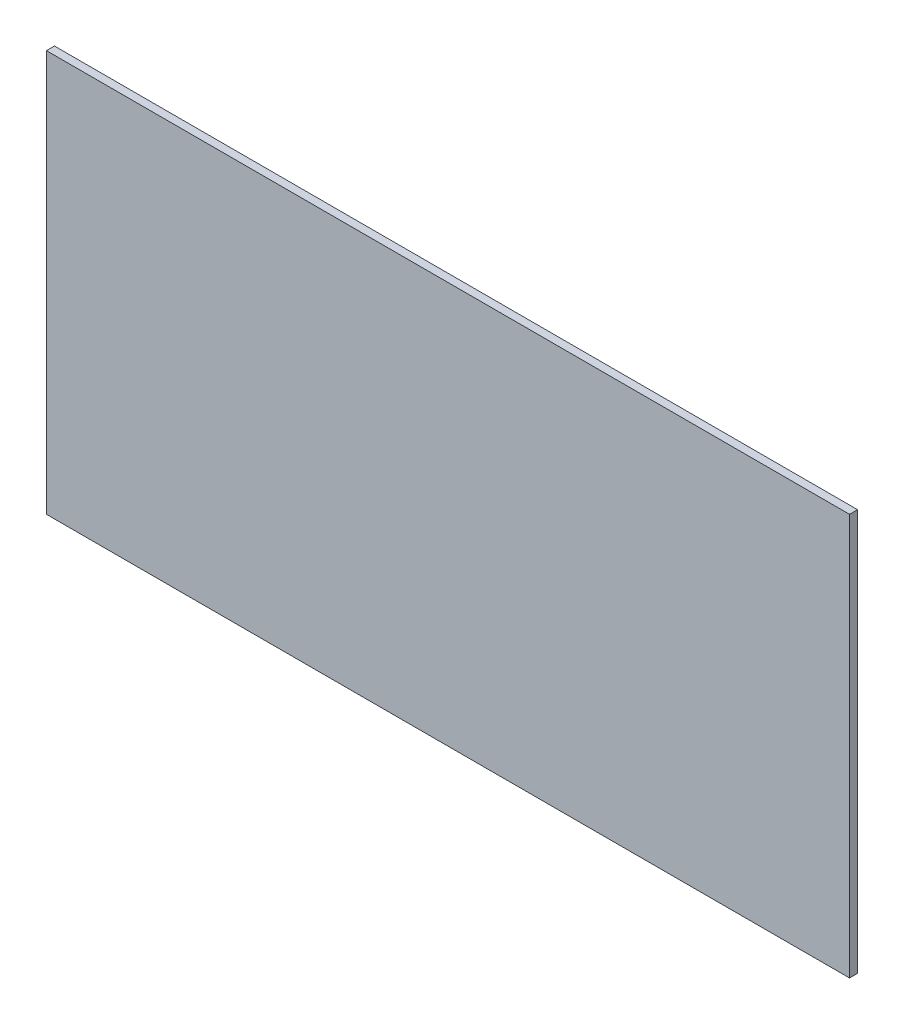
ISO-10303-21;
HEADER;
FILE_DESCRIPTION(('STEP AP214'),'2;1');
FILE_NAME('part.step','',(''),(''),'','','');
FILE_SCHEMA(('AUTOMOTIVE_DESIGN { 1 0 10303 214 1 1 1 1 }'));
ENDSEC;
DATA;
#1=APPLICATION_CONTEXT('core data for automotive mechanical design processes');
#2=APPLICATION_PROTOCOL_DEFINITION('international standard','automotive_design',2000,#1);
#3=PRODUCT_CONTEXT('',#1,'mechanical');
#4=PRODUCT('Part','Part','',(#3));
#5=PRODUCT_RELATED_PRODUCT_CATEGORY('part','',(#4));
#6=PRODUCT_DEFINITION_FORMATION('','',#4);
#7=PRODUCT_DEFINITION_CONTEXT('part definition',#1,'design');
#8=PRODUCT_DEFINITION('design','',#6,#7);
#9=PRODUCT_DEFINITION_SHAPE('','',#8);
#10=(LENGTH_UNIT() NAMED_UNIT(*) SI_UNIT(.MILLI.,.METRE.));
#11=(NAMED_UNIT(*) PLANE_ANGLE_UNIT() SI_UNIT($,.RADIAN.));
#12=(NAMED_UNIT(*) SI_UNIT($,.STERADIAN.) SOLID_ANGLE_UNIT());
#13=UNCERTAINTY_MEASURE_WITH_UNIT(LENGTH_MEASURE(1.E-05),#10,'distance_accuracy_value','');
#14=(GEOMETRIC_REPRESENTATION_CONTEXT(3) GLOBAL_UNCERTAINTY_ASSIGNED_CONTEXT((#13)) GLOBAL_UNIT_ASSIGNED_CONTEXT((#10,
#11,#12)) REPRESENTATION_CONTEXT('',''));
#15=CARTESIAN_POINT('',(0.,0.,0.));
#16=DIRECTION('',(0.,0.,1.));
#17=DIRECTION('',(1.,0.,0.));
#18=AXIS2_PLACEMENT_3D('',#15,#16,#17);
#19=CARTESIAN_POINT('',(0.,0.,2.));
#20=DIRECTION('',(1.,0.,0.));
#21=DIRECTION('',(0.,0.,-1.));
#22=AXIS2_PLACEMENT_3D('',#19,#20,#21);
#23=PLANE('',#22);
#24=DIRECTION('',(0.,-1.,0.));
#25=VECTOR('',#24,1.);
#26=CARTESIAN_POINT('',(0.,0.,0.));
#27=LINE('',#26,#25);
#28=CARTESIAN_POINT('',(0.,100.,0.));
#29=VERTEX_POINT('',#28);
#30=CARTESIAN_POINT('',(0.,0.,0.));
#31=VERTEX_POINT('',#30);
#32=EDGE_CURVE('E97',#29,#31,#27,.T.);
#33=ORIENTED_EDGE('',*,*,#32,.T.);
#34=DIRECTION('',(0.,0.,-1.));
#35=VECTOR('',#34,1.);
#36=CARTESIAN_POINT('',(0.,0.,2.));
#37=LINE('',#36,#35);
#38=CARTESIAN_POINT('',(0.,0.,2.));
#39=VERTEX_POINT('',#38);
#40=EDGE_CURVE('E11',#39,#31,#37,.T.);
#41=ORIENTED_EDGE('',*,*,#40,.F.);
#42=DIRECTION('',(0.,-1.,0.));
#43=VECTOR('',#42,1.);
#44=CARTESIAN_POINT('',(0.,0.,2.));
#45=LINE('',#44,#43);
#46=CARTESIAN_POINT('',(0.,100.,2.));
#47=VERTEX_POINT('',#46);
#48=EDGE_CURVE('E85',#47,#39,#45,.T.);
#49=ORIENTED_EDGE('',*,*,#48,.F.);
#50=DIRECTION('',(0.,0.,-1.));
#51=VECTOR('',#50,1.);
#52=CARTESIAN_POINT('',(0.,100.,2.));
#53=LINE('',#52,#51);
#54=EDGE_CURVE('E93',#47,#29,#53,.T.);
#55=ORIENTED_EDGE('',*,*,#54,.T.);
#56=EDGE_LOOP('',(#33,#41,#49,#55));
#57=FACE_BOUND('',#56,.T.);
#58=ADVANCED_FACE('F34',(#57),#23,.F.);
#59=CARTESIAN_POINT('',(0.,0.,2.));
#60=DIRECTION('',(0.,1.,0.));
#61=DIRECTION('',(0.,0.,1.));
#62=AXIS2_PLACEMENT_3D('',#59,#60,#61);
#63=PLANE('',#62);
#64=DIRECTION('',(1.,0.,0.));
#65=VECTOR('',#64,1.);
#66=CARTESIAN_POINT('',(0.,0.,0.));
#67=LINE('',#66,#65);
#68=CARTESIAN_POINT('',(200.,0.,0.));
#69=VERTEX_POINT('',#68);
#70=EDGE_CURVE('E89',#31,#69,#67,.T.);
#71=ORIENTED_EDGE('',*,*,#70,.T.);
#72=DIRECTION('',(0.,0.,-1.));
#73=VECTOR('',#72,1.);
#74=CARTESIAN_POINT('',(200.,0.,2.));
#75=LINE('',#74,#73);
#76=CARTESIAN_POINT('',(200.,0.,2.));
#77=VERTEX_POINT('',#76);
#78=EDGE_CURVE('E42',#77,#69,#75,.T.);
#79=ORIENTED_EDGE('',*,*,#78,.F.);
#80=DIRECTION('',(1.,0.,0.));
#81=VECTOR('',#80,1.);
#82=CARTESIAN_POINT('',(0.,0.,2.));
#83=LINE('',#82,#81);
#84=EDGE_CURVE('E80',#39,#77,#83,.T.);
#85=ORIENTED_EDGE('',*,*,#84,.F.);
#86=ORIENTED_EDGE('',*,*,#40,.T.);
#87=EDGE_LOOP('',(#71,#79,#85,#86));
#88=FACE_BOUND('',#87,.T.);
#89=ADVANCED_FACE('F88',(#88),#63,.F.);
#90=CARTESIAN_POINT('',(200.,0.,2.));
#91=DIRECTION('',(-1.,0.,0.));
#92=DIRECTION('',(0.,0.,1.));
#93=AXIS2_PLACEMENT_3D('',#90,#91,#92);
#94=PLANE('',#93);
#95=DIRECTION('',(0.,1.,0.));
#96=VECTOR('',#95,1.);
#97=CARTESIAN_POINT('',(200.,0.,0.));
#98=LINE('',#97,#96);
#99=CARTESIAN_POINT('',(200.,100.,0.));
#100=VERTEX_POINT('',#99);
#101=EDGE_CURVE('E67',#69,#100,#98,.T.);
#102=ORIENTED_EDGE('',*,*,#101,.T.);
#103=DIRECTION('',(0.,0.,-1.));
#104=VECTOR('',#103,1.);
#105=CARTESIAN_POINT('',(200.,100.,2.));
#106=LINE('',#105,#104);
#107=CARTESIAN_POINT('',(200.,100.,2.));
#108=VERTEX_POINT('',#107);
#109=EDGE_CURVE('E90',#108,#100,#106,.T.);
#110=ORIENTED_EDGE('',*,*,#109,.F.);
#111=DIRECTION('',(0.,1.,0.));
#112=VECTOR('',#111,1.);
#113=CARTESIAN_POINT('',(200.,0.,2.));
#114=LINE('',#113,#112);
#115=EDGE_CURVE('E83',#77,#108,#114,.T.);
#116=ORIENTED_EDGE('',*,*,#115,.F.);
#117=ORIENTED_EDGE('',*,*,#78,.T.);
#118=EDGE_LOOP('',(#102,#110,#116,#117));
#119=FACE_BOUND('',#118,.T.);
#120=ADVANCED_FACE('F91',(#119),#94,.F.);
#121=CARTESIAN_POINT('',(0.,100.,2.));
#122=DIRECTION('',(0.,-1.,0.));
#123=DIRECTION('',(0.,0.,-1.));
#124=AXIS2_PLACEMENT_3D('',#121,#122,#123);
#125=PLANE('',#124);
#126=DIRECTION('',(-1.,0.,0.));
#127=VECTOR('',#126,1.);
#128=CARTESIAN_POINT('',(0.,100.,0.));
#129=LINE('',#128,#127);
#130=EDGE_CURVE('E73',#100,#29,#129,.T.);
#131=ORIENTED_EDGE('',*,*,#130,.T.);
#132=ORIENTED_EDGE('',*,*,#54,.F.);
#133=DIRECTION('',(-1.,0.,0.));
#134=VECTOR('',#133,1.);
#135=CARTESIAN_POINT('',(0.,100.,2.));
#136=LINE('',#135,#134);
#137=EDGE_CURVE('E50',#108,#47,#136,.T.);
#138=ORIENTED_EDGE('',*,*,#137,.F.);
#139=ORIENTED_EDGE('',*,*,#109,.T.);
#140=EDGE_LOOP('',(#131,#132,#138,#139));
#141=FACE_BOUND('',#140,.T.);
#142=ADVANCED_FACE('F104',(#141),#125,.F.);
#143=CARTESIAN_POINT('',(0.,100.,2.));
#144=DIRECTION('',(0.,0.,-1.));
#145=DIRECTION('',(-1.,0.,0.));
#146=AXIS2_PLACEMENT_3D('',#143,#144,#145);
#147=PLANE('',#146);
#148=ORIENTED_EDGE('',*,*,#48,.T.);
#149=ORIENTED_EDGE('',*,*,#84,.T.);
#150=ORIENTED_EDGE('',*,*,#115,.T.);
#151=ORIENTED_EDGE('',*,*,#137,.T.);
#152=EDGE_LOOP('',(#148,#149,#150,#151));
#153=FACE_BOUND('',#152,.T.);
#154=ADVANCED_FACE('F81',(#153),#147,.F.);
#155=CARTESIAN_POINT('',(0.,100.,0.));
#156=DIRECTION('',(0.,0.,-1.));
#157=DIRECTION('',(-1.,0.,0.));
#158=AXIS2_PLACEMENT_3D('',#155,#156,#157);
#159=PLANE('',#158);
#160=ORIENTED_EDGE('',*,*,#32,.F.);
#161=ORIENTED_EDGE('',*,*,#130,.F.);
#162=ORIENTED_EDGE('',*,*,#101,.F.);
#163=ORIENTED_EDGE('',*,*,#70,.F.);
#164=EDGE_LOOP('',(#160,#161,#162,#163));
#165=FACE_BOUND('',#164,.T.);
#166=ADVANCED_FACE('F107',(#165),#159,.T.);
#167=CLOSED_SHELL('',(#58,#89,#120,#142,#154,#166));
#168=MANIFOLD_SOLID_BREP('B2',#167);
#169=ADVANCED_BREP_SHAPE_REPRESENTATION('',(#18,#168),#14);
#170=SHAPE_DEFINITION_REPRESENTATION(#9,#169);
ENDSEC;
END-ISO-10303-21;
